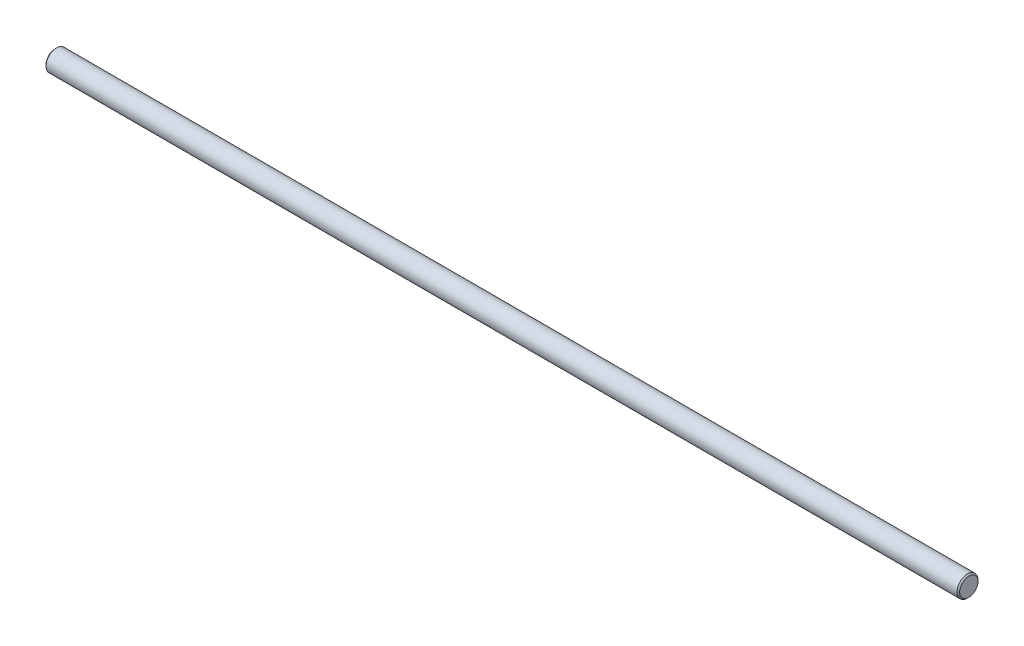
ISO-10303-21;
HEADER;
FILE_DESCRIPTION(('STEP AP214'),'2;1');
FILE_NAME('part.step','',(''),(''),'','','');
FILE_SCHEMA(('AUTOMOTIVE_DESIGN { 1 0 10303 214 1 1 1 1 }'));
ENDSEC;
DATA;
#1=APPLICATION_CONTEXT('core data for automotive mechanical design processes');
#2=APPLICATION_PROTOCOL_DEFINITION('international standard','automotive_design',2000,#1);
#3=PRODUCT_CONTEXT('',#1,'mechanical');
#4=PRODUCT('Part','Part','',(#3));
#5=PRODUCT_RELATED_PRODUCT_CATEGORY('part','',(#4));
#6=PRODUCT_DEFINITION_FORMATION('','',#4);
#7=PRODUCT_DEFINITION_CONTEXT('part definition',#1,'design');
#8=PRODUCT_DEFINITION('design','',#6,#7);
#9=PRODUCT_DEFINITION_SHAPE('','',#8);
#10=(LENGTH_UNIT() NAMED_UNIT(*) SI_UNIT(.MILLI.,.METRE.));
#11=(NAMED_UNIT(*) PLANE_ANGLE_UNIT() SI_UNIT($,.RADIAN.));
#12=(NAMED_UNIT(*) SI_UNIT($,.STERADIAN.) SOLID_ANGLE_UNIT());
#13=UNCERTAINTY_MEASURE_WITH_UNIT(LENGTH_MEASURE(1.E-05),#10,'distance_accuracy_value','');
#14=(GEOMETRIC_REPRESENTATION_CONTEXT(3) GLOBAL_UNCERTAINTY_ASSIGNED_CONTEXT((#13)) GLOBAL_UNIT_ASSIGNED_CONTEXT((#10,
#11,#12)) REPRESENTATION_CONTEXT('',''));
#15=CARTESIAN_POINT('',(0.,0.,0.));
#16=DIRECTION('',(0.,0.,1.));
#17=DIRECTION('',(1.,0.,0.));
#18=AXIS2_PLACEMENT_3D('',#15,#16,#17);
#19=CARTESIAN_POINT('',(174.,0.,0.));
#20=DIRECTION('',(1.,0.,0.));
#21=DIRECTION('',(0.,0.,-1.));
#22=AXIS2_PLACEMENT_3D('',#19,#20,#21);
#23=PLANE('',#22);
#24=CARTESIAN_POINT('',(173.999999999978,0.,0.));
#25=DIRECTION('',(-1.,0.,0.));
#26=DIRECTION('',(0.,0.,1.));
#27=AXIS2_PLACEMENT_3D('',#24,#25,#26);
#28=CIRCLE('',#27,3.50000000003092);
#29=CARTESIAN_POINT('',(173.999999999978,0.,3.50000000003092));
#30=VERTEX_POINT('',#29);
#31=EDGE_CURVE('E18',#30,#30,#28,.T.);
#32=ORIENTED_EDGE('',*,*,#31,.F.);
#33=EDGE_LOOP('',(#32));
#34=FACE_BOUND('',#33,.T.);
#35=ADVANCED_FACE('F15',(#34),#23,.T.);
#36=CARTESIAN_POINT('',(-174.,0.,0.));
#37=DIRECTION('',(1.,0.,0.));
#38=DIRECTION('',(0.,0.,-1.));
#39=AXIS2_PLACEMENT_3D('',#36,#37,#38);
#40=PLANE('',#39);
#41=CARTESIAN_POINT('',(-173.999999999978,0.,0.));
#42=DIRECTION('',(1.,0.,0.));
#43=DIRECTION('',(0.,0.,-1.));
#44=AXIS2_PLACEMENT_3D('',#41,#42,#43);
#45=CIRCLE('',#44,3.50000000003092);
#46=CARTESIAN_POINT('',(-173.999999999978,0.,-3.50000000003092));
#47=VERTEX_POINT('',#46);
#48=EDGE_CURVE('E28',#47,#47,#45,.T.);
#49=ORIENTED_EDGE('',*,*,#48,.F.);
#50=EDGE_LOOP('',(#49));
#51=FACE_BOUND('',#50,.T.);
#52=ADVANCED_FACE('F41',(#51),#40,.F.);
#53=CARTESIAN_POINT('',(173.500000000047,0.,0.));
#54=DIRECTION('',(-1.,0.,0.));
#55=DIRECTION('',(0.,0.,1.));
#56=AXIS2_PLACEMENT_3D('',#53,#54,#55);
#57=CONICAL_SURFACE('',#56,3.99999999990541,0.785398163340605);
#58=CARTESIAN_POINT('',(173.5,0.,0.));
#59=DIRECTION('',(1.,0.,0.));
#60=DIRECTION('',(0.,0.,-1.));
#61=AXIS2_PLACEMENT_3D('',#58,#59,#60);
#62=CIRCLE('',#61,4.);
#63=CARTESIAN_POINT('',(173.5,0.,-4.));
#64=VERTEX_POINT('',#63);
#65=EDGE_CURVE('E22',#64,#64,#62,.F.);
#66=ORIENTED_EDGE('',*,*,#65,.F.);
#67=EDGE_LOOP('',(#66));
#68=FACE_BOUND('',#67,.T.);
#69=ORIENTED_EDGE('',*,*,#31,.T.);
#70=EDGE_LOOP('',(#69));
#71=FACE_BOUND('',#70,.T.);
#72=ADVANCED_FACE('F38',(#68,#71),#57,.T.);
#73=CARTESIAN_POINT('',(-173.500000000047,0.,0.));
#74=DIRECTION('',(1.,0.,0.));
#75=DIRECTION('',(0.,0.,-1.));
#76=AXIS2_PLACEMENT_3D('',#73,#74,#75);
#77=CONICAL_SURFACE('',#76,3.99999999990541,0.785398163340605);
#78=CARTESIAN_POINT('',(-173.5,0.,0.));
#79=DIRECTION('',(1.,0.,0.));
#80=DIRECTION('',(0.,0.,-1.));
#81=AXIS2_PLACEMENT_3D('',#78,#79,#80);
#82=CIRCLE('',#81,4.);
#83=CARTESIAN_POINT('',(-173.5,0.,-4.));
#84=VERTEX_POINT('',#83);
#85=EDGE_CURVE('E10',#84,#84,#82,.T.);
#86=ORIENTED_EDGE('',*,*,#85,.F.);
#87=EDGE_LOOP('',(#86));
#88=FACE_BOUND('',#87,.T.);
#89=ORIENTED_EDGE('',*,*,#48,.T.);
#90=EDGE_LOOP('',(#89));
#91=FACE_BOUND('',#90,.T.);
#92=ADVANCED_FACE('F49',(#88,#91),#77,.T.);
#93=CARTESIAN_POINT('',(-174.,0.,0.));
#94=DIRECTION('',(1.,0.,0.));
#95=DIRECTION('',(0.,0.,-1.));
#96=AXIS2_PLACEMENT_3D('',#93,#94,#95);
#97=CYLINDRICAL_SURFACE('',#96,4.);
#98=ORIENTED_EDGE('',*,*,#65,.T.);
#99=EDGE_LOOP('',(#98));
#100=FACE_BOUND('',#99,.T.);
#101=ORIENTED_EDGE('',*,*,#85,.T.);
#102=EDGE_LOOP('',(#101));
#103=FACE_BOUND('',#102,.T.);
#104=ADVANCED_FACE('F47',(#100,#103),#97,.T.);
#105=CLOSED_SHELL('',(#35,#52,#72,#92,#104));
#106=MANIFOLD_SOLID_BREP('B1',#105);
#107=ADVANCED_BREP_SHAPE_REPRESENTATION('',(#18,#106),#14);
#108=SHAPE_DEFINITION_REPRESENTATION(#9,#107);
ENDSEC;
END-ISO-10303-21;
